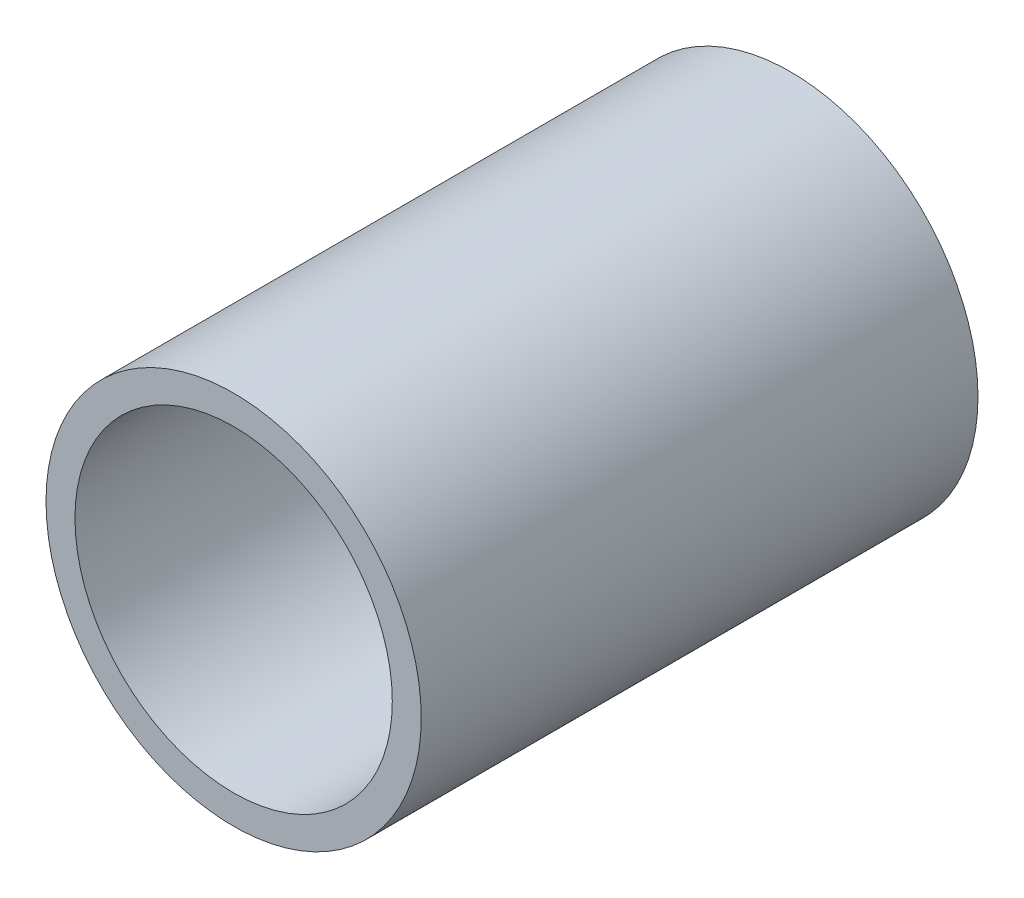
from build123d import *

# Parameters (mm, degrees)
ROHRSKIZZE_R             = 16.85
ROHRSKIZZE_R_2           = 14.25
LINEARE_AUSTRAGUNG_DEPTH = 50


with BuildPart() as part:
    # RohrSkizze → Lineare Austragung (new body)
    with BuildSketch(Plane.XY):
        Circle(ROHRSKIZZE_R)
        Circle(ROHRSKIZZE_R_2, mode=Mode.SUBTRACT)
    extrude(amount=LINEARE_AUSTRAGUNG_DEPTH)


solid = part.part
